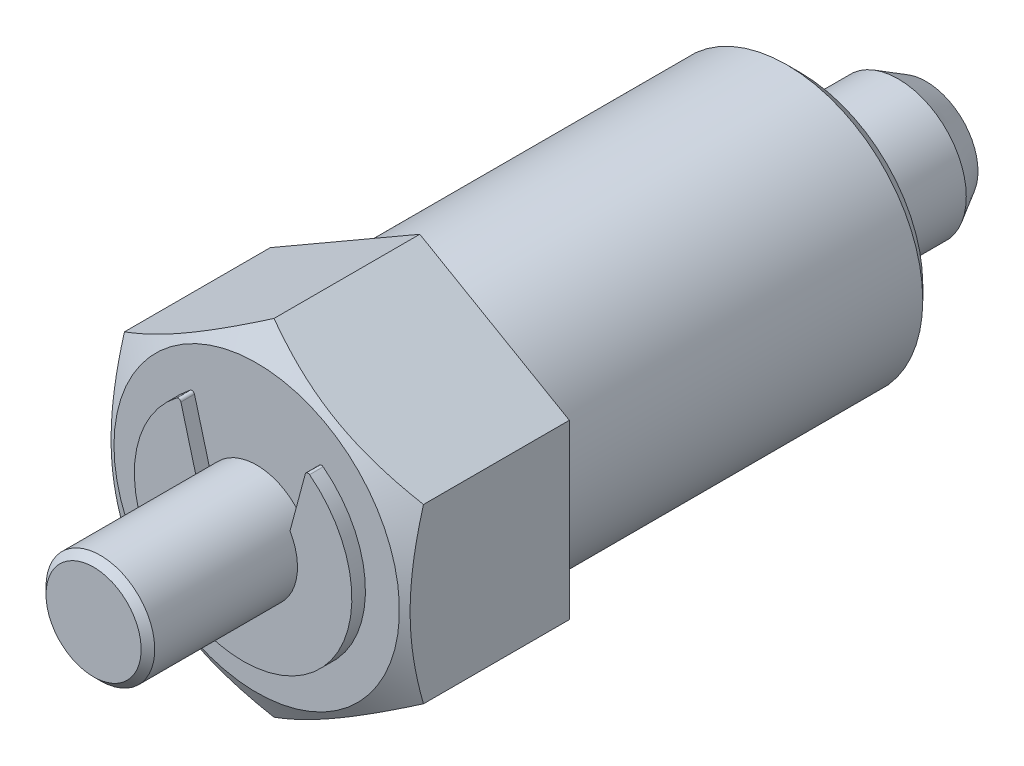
ISO-10303-21;
HEADER;
FILE_DESCRIPTION(('STEP AP214'),'2;1');
FILE_NAME('part.step','',(''),(''),'','','');
FILE_SCHEMA(('AUTOMOTIVE_DESIGN { 1 0 10303 214 1 1 1 1 }'));
ENDSEC;
DATA;
#1=APPLICATION_CONTEXT('core data for automotive mechanical design processes');
#2=APPLICATION_PROTOCOL_DEFINITION('international standard','automotive_design',2000,#1);
#3=PRODUCT_CONTEXT('',#1,'mechanical');
#4=PRODUCT('Part','Part','',(#3));
#5=PRODUCT_RELATED_PRODUCT_CATEGORY('part','',(#4));
#6=PRODUCT_DEFINITION_FORMATION('','',#4);
#7=PRODUCT_DEFINITION_CONTEXT('part definition',#1,'design');
#8=PRODUCT_DEFINITION('design','',#6,#7);
#9=PRODUCT_DEFINITION_SHAPE('','',#8);
#10=(LENGTH_UNIT() NAMED_UNIT(*) SI_UNIT(.MILLI.,.METRE.));
#11=(NAMED_UNIT(*) PLANE_ANGLE_UNIT() SI_UNIT($,.RADIAN.));
#12=(NAMED_UNIT(*) SI_UNIT($,.STERADIAN.) SOLID_ANGLE_UNIT());
#13=UNCERTAINTY_MEASURE_WITH_UNIT(LENGTH_MEASURE(1.E-05),#10,'distance_accuracy_value','');
#14=(GEOMETRIC_REPRESENTATION_CONTEXT(3) GLOBAL_UNCERTAINTY_ASSIGNED_CONTEXT((#13)) GLOBAL_UNIT_ASSIGNED_CONTEXT((#10,
#11,#12)) REPRESENTATION_CONTEXT('',''));
#15=CARTESIAN_POINT('',(0.,0.,0.));
#16=DIRECTION('',(0.,0.,1.));
#17=DIRECTION('',(1.,0.,0.));
#18=AXIS2_PLACEMENT_3D('',#15,#16,#17);
#19=CARTESIAN_POINT('',(10.626,-10.6625637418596,11.9999999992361));
#20=DIRECTION('',(0.,7.16445197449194E-11,-1.));
#21=DIRECTION('',(-1.,0.,0.));
#22=AXIS2_PLACEMENT_3D('',#19,#20,#21);
#23=PLANE('',#22);
#24=CARTESIAN_POINT('',(0.,-8.59728954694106E-10,12.));
#25=DIRECTION('',(0.,7.16445197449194E-11,-1.));
#26=DIRECTION('',(-1.,0.,0.));
#27=AXIS2_PLACEMENT_3D('',#24,#25,#26);
#28=CIRCLE('',#27,10.5);
#29=CARTESIAN_POINT('',(-10.5,-8.59728954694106E-10,12.));
#30=VERTEX_POINT('',#29);
#31=EDGE_CURVE('E260',#30,#30,#28,.T.);
#32=ORIENTED_EDGE('',*,*,#31,.F.);
#33=EDGE_LOOP('',(#32));
#34=FACE_BOUND('',#33,.T.);
#35=DIRECTION('',(-0.258819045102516,-0.96592582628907,-6.92033067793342E-11));
#36=VECTOR('',#35,1.);
#37=CARTESIAN_POINT('',(3.45,2.02422824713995,12.000000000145));
#38=LINE('',#37,#36);
#39=CARTESIAN_POINT('',(4.57541189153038,6.22432260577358,12.0000000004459));
#40=VERTEX_POINT('',#39);
#41=CARTESIAN_POINT('',(3.45,2.02422824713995,12.000000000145));
#42=VERTEX_POINT('',#41);
#43=EDGE_CURVE('E263',#40,#42,#38,.T.);
#44=ORIENTED_EDGE('',*,*,#43,.F.);
#45=CARTESIAN_POINT('',(4.76859705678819,6.17255879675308,12.0000000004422));
#46=DIRECTION('',(0.,-7.16445197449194E-11,1.));
#47=DIRECTION('',(0.,-1.,-7.16445197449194E-11));
#48=AXIS2_PLACEMENT_3D('',#45,#46,#47);
#49=CIRCLE('',#48,0.200000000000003);
#50=CARTESIAN_POINT('',(4.89086877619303,6.33082953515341,12.0000000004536));
#51=VERTEX_POINT('',#50);
#52=EDGE_CURVE('E265',#51,#40,#49,.T.);
#53=ORIENTED_EDGE('',*,*,#52,.F.);
#54=CARTESIAN_POINT('',(0.,-8.59734236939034E-10,12.));
#55=DIRECTION('',(0.,-7.16445197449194E-11,1.));
#56=DIRECTION('',(0.,-1.,-7.16445197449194E-11));
#57=AXIS2_PLACEMENT_3D('',#54,#55,#56);
#58=CIRCLE('',#57,7.99999999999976);
#59=CARTESIAN_POINT('',(-4.89086877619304,6.33082953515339,12.0000000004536));
#60=VERTEX_POINT('',#59);
#61=EDGE_CURVE('E268',#60,#51,#58,.T.);
#62=ORIENTED_EDGE('',*,*,#61,.F.);
#63=CARTESIAN_POINT('',(-4.76859705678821,6.17255879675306,12.0000000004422));
#64=DIRECTION('',(0.,-7.16445197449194E-11,1.));
#65=DIRECTION('',(0.,-1.,-7.16445197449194E-11));
#66=AXIS2_PLACEMENT_3D('',#63,#64,#65);
#67=CIRCLE('',#66,0.200000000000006);
#68=CARTESIAN_POINT('',(-4.57541189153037,6.22432260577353,12.0000000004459));
#69=VERTEX_POINT('',#68);
#70=EDGE_CURVE('E123',#69,#60,#67,.T.);
#71=ORIENTED_EDGE('',*,*,#70,.F.);
#72=DIRECTION('',(-0.258819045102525,0.965925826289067,6.92033067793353E-11));
#73=VECTOR('',#72,1.);
#74=CARTESIAN_POINT('',(-3.45,2.02422824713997,12.000000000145));
#75=LINE('',#74,#73);
#76=CARTESIAN_POINT('',(-3.45,2.02422824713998,12.000000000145));
#77=VERTEX_POINT('',#76);
#78=EDGE_CURVE('E117',#77,#69,#75,.T.);
#79=ORIENTED_EDGE('',*,*,#78,.F.);
#80=CARTESIAN_POINT('',(0.,-8.59728954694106E-10,12.));
#81=DIRECTION('',(0.,-7.16445197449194E-11,1.));
#82=DIRECTION('',(1.,0.,0.));
#83=AXIS2_PLACEMENT_3D('',#80,#81,#82);
#84=CIRCLE('',#83,4.);
#85=EDGE_CURVE('E150',#42,#77,#84,.T.);
#86=ORIENTED_EDGE('',*,*,#85,.F.);
#87=EDGE_LOOP('',(#44,#53,#62,#71,#79,#86));
#88=FACE_BOUND('',#87,.T.);
#89=ADVANCED_FACE('F14',(#34,#88),#23,.F.);
#90=CARTESIAN_POINT('',(0.,-8.59728954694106E-10,12.));
#91=DIRECTION('',(0.,-7.16445197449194E-11,1.));
#92=DIRECTION('',(1.,0.,0.));
#93=AXIS2_PLACEMENT_3D('',#90,#91,#92);
#94=CYLINDRICAL_SURFACE('',#93,4.);
#95=CARTESIAN_POINT('',(0.,-1.68362546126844E-09,23.5));
#96=DIRECTION('',(0.,7.16445197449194E-11,-1.));
#97=DIRECTION('',(-1.,0.,0.));
#98=AXIS2_PLACEMENT_3D('',#95,#96,#97);
#99=CIRCLE('',#98,4.);
#100=CARTESIAN_POINT('',(-4.,-1.68362546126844E-09,23.5));
#101=VERTEX_POINT('',#100);
#102=EDGE_CURVE('E9',#101,#101,#99,.F.);
#103=ORIENTED_EDGE('',*,*,#102,.F.);
#104=EDGE_LOOP('',(#103));
#105=FACE_BOUND('',#104,.T.);
#106=DIRECTION('',(0.,7.16445197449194E-11,-1.));
#107=VECTOR('',#106,1.);
#108=CARTESIAN_POINT('',(3.45,2.0242282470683,13.000000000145));
#109=LINE('',#108,#107);
#110=CARTESIAN_POINT('',(3.45,2.02422824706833,13.000000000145));
#111=VERTEX_POINT('',#110);
#112=EDGE_CURVE('E31',#111,#42,#109,.T.);
#113=ORIENTED_EDGE('',*,*,#112,.T.);
#114=ORIENTED_EDGE('',*,*,#85,.T.);
#115=DIRECTION('',(0.,7.16445197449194E-11,-1.));
#116=VECTOR('',#115,1.);
#117=CARTESIAN_POINT('',(-3.45,2.02422824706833,13.000000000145));
#118=LINE('',#117,#116);
#119=CARTESIAN_POINT('',(-3.45,2.02422824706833,13.000000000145));
#120=VERTEX_POINT('',#119);
#121=EDGE_CURVE('E144',#120,#77,#118,.T.);
#122=ORIENTED_EDGE('',*,*,#121,.F.);
#123=CARTESIAN_POINT('',(0.,-9.31378756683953E-10,13.));
#124=DIRECTION('',(0.,7.16445197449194E-11,-1.));
#125=DIRECTION('',(0.,-1.,-7.16445197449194E-11));
#126=AXIS2_PLACEMENT_3D('',#123,#124,#125);
#127=CIRCLE('',#126,4.);
#128=EDGE_CURVE('E135',#111,#120,#127,.T.);
#129=ORIENTED_EDGE('',*,*,#128,.F.);
#130=EDGE_LOOP('',(#113,#114,#122,#129));
#131=FACE_BOUND('',#130,.T.);
#132=ADVANCED_FACE('F148',(#105,#131),#94,.T.);
#133=CARTESIAN_POINT('',(-7.71365193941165E-11,2.4530655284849E-09,-28.0000000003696));
#134=DIRECTION('',(-1.,0.,0.));
#135=DIRECTION('',(0.,7.16445197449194E-11,-1.));
#136=AXIS2_PLACEMENT_3D('',#133,#134,#135);
#137=SPHERICAL_SURFACE('',#136,10.);
#138=CARTESIAN_POINT('',(0.,2.66811572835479E-09,-37.2409344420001));
#139=DIRECTION('',(0.,-7.16445197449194E-11,1.));
#140=DIRECTION('',(1.,0.,0.));
#141=AXIS2_PLACEMENT_3D('',#138,#139,#140);
#142=CIRCLE('',#141,3.82166595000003);
#143=CARTESIAN_POINT('',(3.82166595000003,2.66811572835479E-09,-37.2409344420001));
#144=VERTEX_POINT('',#143);
#145=EDGE_CURVE('E18',#144,#144,#142,.T.);
#146=ORIENTED_EDGE('',*,*,#145,.F.);
#147=EDGE_LOOP('',(#146));
#148=FACE_BOUND('',#147,.T.);
#149=ADVANCED_FACE('F167',(#148),#137,.T.);
#150=CARTESIAN_POINT('',(0.,2.66811572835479E-09,-37.2409344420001));
#151=DIRECTION('',(0.,-7.16445197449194E-11,1.));
#152=DIRECTION('',(1.,0.,0.));
#153=AXIS2_PLACEMENT_3D('',#150,#151,#152);
#154=CONICAL_SURFACE('',#153,3.82166595,0.523598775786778);
#155=CARTESIAN_POINT('',(0.,2.52189935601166E-09,-35.2));
#156=DIRECTION('',(0.,7.16445197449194E-11,-1.));
#157=DIRECTION('',(-1.,0.,0.));
#158=AXIS2_PLACEMENT_3D('',#155,#156,#157);
#159=CIRCLE('',#158,5.);
#160=CARTESIAN_POINT('',(-5.,2.52189935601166E-09,-35.2));
#161=VERTEX_POINT('',#160);
#162=EDGE_CURVE('E498',#161,#161,#159,.F.);
#163=ORIENTED_EDGE('',*,*,#162,.F.);
#164=EDGE_LOOP('',(#163));
#165=FACE_BOUND('',#164,.T.);
#166=ORIENTED_EDGE('',*,*,#145,.T.);
#167=EDGE_LOOP('',(#166));
#168=FACE_BOUND('',#167,.T.);
#169=ADVANCED_FACE('F171',(#165,#168),#154,.T.);
#170=CARTESIAN_POINT('',(0.,2.00606198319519E-09,-28.));
#171=DIRECTION('',(0.,7.16445197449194E-11,-1.));
#172=DIRECTION('',(-1.,0.,0.));
#173=AXIS2_PLACEMENT_3D('',#170,#171,#172);
#174=CYLINDRICAL_SURFACE('',#173,5.);
#175=ORIENTED_EDGE('',*,*,#162,.T.);
#176=EDGE_LOOP('',(#175));
#177=FACE_BOUND('',#176,.T.);
#178=CARTESIAN_POINT('',(0.,2.00606198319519E-09,-28.));
#179=DIRECTION('',(0.,7.16445197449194E-11,-1.));
#180=DIRECTION('',(-1.,0.,0.));
#181=AXIS2_PLACEMENT_3D('',#178,#179,#180);
#182=CIRCLE('',#181,5.);
#183=CARTESIAN_POINT('',(-5.,2.00606198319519E-09,-28.));
#184=VERTEX_POINT('',#183);
#185=EDGE_CURVE('E501',#184,#184,#182,.T.);
#186=ORIENTED_EDGE('',*,*,#185,.T.);
#187=EDGE_LOOP('',(#186));
#188=FACE_BOUND('',#187,.T.);
#189=ADVANCED_FACE('F177',(#177,#188),#174,.T.);
#190=CARTESIAN_POINT('',(-9.108325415,-9.17838616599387,-28.0000000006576));
#191=DIRECTION('',(0.,-7.16445197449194E-11,1.));
#192=DIRECTION('',(1.,0.,0.));
#193=AXIS2_PLACEMENT_3D('',#190,#191,#192);
#194=PLANE('',#193);
#195=ORIENTED_EDGE('',*,*,#185,.F.);
#196=EDGE_LOOP('',(#195));
#197=FACE_BOUND('',#196,.T.);
#198=CARTESIAN_POINT('',(0.,2.00606198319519E-09,-28.));
#199=DIRECTION('',(0.,-7.16445197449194E-11,1.));
#200=DIRECTION('',(1.,0.,0.));
#201=AXIS2_PLACEMENT_3D('',#198,#199,#200);
#202=CIRCLE('',#201,9.);
#203=CARTESIAN_POINT('',(9.,2.00606198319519E-09,-28.));
#204=VERTEX_POINT('',#203);
#205=EDGE_CURVE('E497',#204,#204,#202,.T.);
#206=ORIENTED_EDGE('',*,*,#205,.F.);
#207=EDGE_LOOP('',(#206));
#208=FACE_BOUND('',#207,.T.);
#209=ADVANCED_FACE('F181',(#197,#208),#194,.F.);
#210=CARTESIAN_POINT('',(0.,2.00606198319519E-09,-28.));
#211=DIRECTION('',(0.,-7.16445197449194E-11,1.));
#212=DIRECTION('',(1.,0.,0.));
#213=AXIS2_PLACEMENT_3D('',#210,#211,#212);
#214=CONICAL_SURFACE('',#213,9.,0.785398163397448);
#215=ORIENTED_EDGE('',*,*,#205,.T.);
#216=EDGE_LOOP('',(#215));
#217=FACE_BOUND('',#216,.T.);
#218=CARTESIAN_POINT('',(0.,1.93442484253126E-09,-27.));
#219=DIRECTION('',(0.,7.16445197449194E-11,-1.));
#220=DIRECTION('',(-1.,0.,0.));
#221=AXIS2_PLACEMENT_3D('',#218,#219,#220);
#222=CIRCLE('',#221,10.);
#223=CARTESIAN_POINT('',(-10.,1.93442484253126E-09,-27.));
#224=VERTEX_POINT('',#223);
#225=EDGE_CURVE('E494',#224,#224,#222,.F.);
#226=ORIENTED_EDGE('',*,*,#225,.F.);
#227=EDGE_LOOP('',(#226));
#228=FACE_BOUND('',#227,.T.);
#229=ADVANCED_FACE('F183',(#217,#228),#214,.T.);
#230=CARTESIAN_POINT('',(0.,0.,0.));
#231=DIRECTION('',(0.,7.16445197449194E-11,-1.));
#232=DIRECTION('',(-1.,0.,0.));
#233=AXIS2_PLACEMENT_3D('',#230,#231,#232);
#234=CYLINDRICAL_SURFACE('',#233,10.);
#235=CARTESIAN_POINT('',(0.,0.,0.));
#236=DIRECTION('',(0.,7.16445197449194E-11,-1.));
#237=DIRECTION('',(-1.,0.,0.));
#238=AXIS2_PLACEMENT_3D('',#235,#236,#237);
#239=CIRCLE('',#238,10.);
#240=CARTESIAN_POINT('',(-10.,0.,0.));
#241=VERTEX_POINT('',#240);
#242=EDGE_CURVE('E484',#241,#241,#239,.F.);
#243=ORIENTED_EDGE('',*,*,#242,.F.);
#244=EDGE_LOOP('',(#243));
#245=FACE_BOUND('',#244,.T.);
#246=ORIENTED_EDGE('',*,*,#225,.T.);
#247=EDGE_LOOP('',(#246));
#248=FACE_BOUND('',#247,.T.);
#249=ADVANCED_FACE('F186',(#245,#248),#234,.T.);
#250=CARTESIAN_POINT('',(11.,-12.8541263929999,-9.20902243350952E-10));
#251=DIRECTION('',(0.,7.16445197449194E-11,-1.));
#252=DIRECTION('',(-1.,0.,0.));
#253=AXIS2_PLACEMENT_3D('',#250,#251,#252);
#254=PLANE('',#253);
#255=ORIENTED_EDGE('',*,*,#242,.T.);
#256=EDGE_LOOP('',(#255));
#257=FACE_BOUND('',#256,.T.);
#258=DIRECTION('',(0.,1.,7.16445197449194E-11));
#259=VECTOR('',#258,1.);
#260=CARTESIAN_POINT('',(11.,5.00072205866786E-10,0.));
#261=LINE('',#260,#259);
#262=CARTESIAN_POINT('',(11.,-6.35085296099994,-4.54997151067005E-10));
#263=VERTEX_POINT('',#262);
#264=CARTESIAN_POINT('',(11.,6.35085296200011,4.5502490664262E-10));
#265=VERTEX_POINT('',#264);
#266=EDGE_CURVE('E489',#263,#265,#261,.T.);
#267=ORIENTED_EDGE('',*,*,#266,.F.);
#268=DIRECTION('',(0.866025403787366,0.49999999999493,3.58222598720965E-11));
#269=VECTOR('',#268,1.);
#270=CARTESIAN_POINT('',(5.5,-9.52627944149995,-6.82481848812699E-10));
#271=LINE('',#270,#269);
#272=CARTESIAN_POINT('',(0.,-12.701705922,-9.0999430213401E-10));
#273=VERTEX_POINT('',#272);
#274=EDGE_CURVE('E492',#273,#263,#271,.T.);
#275=ORIENTED_EDGE('',*,*,#274,.F.);
#276=DIRECTION('',(0.866025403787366,-0.49999999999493,-3.58222598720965E-11));
#277=VECTOR('',#276,1.);
#278=CARTESIAN_POINT('',(-5.5,-9.52627944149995,-6.82481848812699E-10));
#279=LINE('',#278,#277);
#280=CARTESIAN_POINT('',(-11.0000000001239,-6.35085296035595,-4.54997151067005E-10));
#281=VERTEX_POINT('',#280);
#282=EDGE_CURVE('E87',#281,#273,#279,.T.);
#283=ORIENTED_EDGE('',*,*,#282,.F.);
#284=DIRECTION('',(0.,-1.,-7.16445197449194E-11));
#285=VECTOR('',#284,1.);
#286=CARTESIAN_POINT('',(-11.,5.00072205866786E-10,0.));
#287=LINE('',#286,#285);
#288=CARTESIAN_POINT('',(-11.,6.35085296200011,4.5502490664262E-10));
#289=VERTEX_POINT('',#288);
#290=EDGE_CURVE('E475',#289,#281,#287,.T.);
#291=ORIENTED_EDGE('',*,*,#290,.F.);
#292=DIRECTION('',(-0.866025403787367,-0.499999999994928,-3.58222598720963E-11));
#293=VECTOR('',#292,1.);
#294=CARTESIAN_POINT('',(-5.5,9.52627944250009,6.82509604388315E-10));
#295=LINE('',#294,#293);
#296=CARTESIAN_POINT('',(0.,12.7017059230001,9.10022057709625E-10));
#297=VERTEX_POINT('',#296);
#298=EDGE_CURVE('E67',#297,#289,#295,.T.);
#299=ORIENTED_EDGE('',*,*,#298,.F.);
#300=DIRECTION('',(-0.866025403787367,0.499999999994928,3.58222598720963E-11));
#301=VECTOR('',#300,1.);
#302=CARTESIAN_POINT('',(5.5,9.52627944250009,6.82509604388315E-10));
#303=LINE('',#302,#301);
#304=EDGE_CURVE('E485',#265,#297,#303,.T.);
#305=ORIENTED_EDGE('',*,*,#304,.F.);
#306=EDGE_LOOP('',(#267,#275,#283,#291,#299,#305));
#307=FACE_BOUND('',#306,.T.);
#308=ADVANCED_FACE('F190',(#257,#307),#254,.T.);
#309=CARTESIAN_POINT('',(-11.,-6.35085296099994,-4.54997151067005E-10));
#310=DIRECTION('',(-0.49999999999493,-0.866025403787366,-6.20459741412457E-11));
#311=DIRECTION('',(0.866025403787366,-0.49999999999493,-3.58222598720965E-11));
#312=AXIS2_PLACEMENT_3D('',#309,#310,#311);
#313=PLANE('',#312);
#314=DIRECTION('',(0.,-7.16445197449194E-11,1.));
#315=VECTOR('',#314,1.);
#316=CARTESIAN_POINT('',(-11.,-6.35085296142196,5.89079640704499));
#317=LINE('',#316,#315);
#318=CARTESIAN_POINT('',(-11.0000000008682,-6.35085296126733,10.7288444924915));
#319=VERTEX_POINT('',#318);
#320=EDGE_CURVE('E479',#281,#319,#317,.T.);
#321=ORIENTED_EDGE('',*,*,#320,.F.);
#322=ORIENTED_EDGE('',*,*,#282,.T.);
#323=DIRECTION('',(0.,7.16445197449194E-11,-1.));
#324=VECTOR('',#323,1.);
#325=CARTESIAN_POINT('',(0.,-12.7017059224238,5.91538969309));
#326=LINE('',#325,#324);
#327=CARTESIAN_POINT('',(7.50439263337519E-10,-12.7017059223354,10.7288444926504));
#328=VERTEX_POINT('',#327);
#329=EDGE_CURVE('E164',#328,#273,#326,.T.);
#330=ORIENTED_EDGE('',*,*,#329,.F.);
#331=CARTESIAN_POINT('',(-11.0000000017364,-6.35085296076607,10.7288444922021));
#332=CARTESIAN_POINT('',(-10.7581978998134,-6.49045746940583,10.8094296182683));
#333=CARTESIAN_POINT('',(-10.5154942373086,-6.63058249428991,10.886357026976));
#334=CARTESIAN_POINT('',(-10.0281406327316,-6.91195622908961,11.0318815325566));
#335=CARTESIAN_POINT('',(-9.78349007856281,-7.05320529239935,11.1004758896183));
#336=CARTESIAN_POINT('',(-9.04559653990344,-7.47922832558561,11.2924318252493));
#337=CARTESIAN_POINT('',(-8.54944068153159,-7.76568404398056,11.4016142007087));
#338=CARTESIAN_POINT('',(-7.80696622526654,-8.19435187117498,11.5296384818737));
#339=CARTESIAN_POINT('',(-7.56286565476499,-8.3352834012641,11.5661073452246));
#340=CARTESIAN_POINT('',(-7.07353439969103,-8.61779893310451,11.6272621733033));
#341=CARTESIAN_POINT('',(-6.82830369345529,-8.75938294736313,11.6519479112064));
#342=CARTESIAN_POINT('',(-6.33743351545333,-9.04278697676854,11.6889041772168));
#343=CARTESIAN_POINT('',(-6.09179487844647,-9.18460650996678,11.7011894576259));
#344=CARTESIAN_POINT('',(-5.60029010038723,-9.46837692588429,11.7130830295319));
#345=CARTESIAN_POINT('',(-5.35442396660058,-9.61032780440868,11.7126917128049));
#346=CARTESIAN_POINT('',(-4.89478887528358,-9.87569824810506,11.7001175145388));
#347=CARTESIAN_POINT('',(-4.68098711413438,-9.99913675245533,11.6894684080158));
#348=CARTESIAN_POINT('',(-4.25387535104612,-10.2457298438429,11.6587846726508));
#349=CARTESIAN_POINT('',(-4.04056538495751,-10.3688844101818,11.6387493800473));
#350=CARTESIAN_POINT('',(-3.61455312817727,-10.6148427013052,11.5896425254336));
#351=CARTESIAN_POINT('',(-3.40185148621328,-10.7376460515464,11.5605635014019));
#352=CARTESIAN_POINT('',(-2.97744534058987,-10.9826770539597,11.4938793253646));
#353=CARTESIAN_POINT('',(-2.76574090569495,-11.1049046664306,11.4562735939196));
#354=CARTESIAN_POINT('',(-2.12310090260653,-11.4759330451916,11.3297157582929));
#355=CARTESIAN_POINT('',(-1.69402620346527,-11.7236594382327,11.2281451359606));
#356=CARTESIAN_POINT('',(-0.842274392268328,-12.2154185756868,10.9976221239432));
#357=CARTESIAN_POINT('',(-0.419586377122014,-12.4594576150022,10.8687238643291));
#358=CARTESIAN_POINT('',(1.16254223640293E-09,-12.7017059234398,10.7288444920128));
#359=B_SPLINE_CURVE_WITH_KNOTS('',3,(#331,#332,#333,#334,#335,#336,#337,#338,#339,#340,#341,
#342,#343,#344,#345,#346,#347,#348,#349,#350,#351,#352,#353,#354,#355,#356,#357,#358),
.UNSPECIFIED.,.F.,.F.,(4,2,2,2,2,2,2,2,2,2,2,2,2,4),(0.,0.871747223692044,1.74378029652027,
3.49155822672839,4.34399745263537,5.19645308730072,6.04789339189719,6.8993073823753,
7.64044859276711,8.38164222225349,9.12344904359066,9.86530629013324,11.3816421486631,
12.8950020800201),.UNSPECIFIED.);
#360=EDGE_CURVE('E220',#319,#328,#359,.T.);
#361=ORIENTED_EDGE('',*,*,#360,.F.);
#362=EDGE_LOOP('',(#321,#322,#330,#361));
#363=FACE_BOUND('',#362,.T.);
#364=ADVANCED_FACE('F392',(#363),#313,.T.);
#365=CARTESIAN_POINT('',(0.,-12.701705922,-9.0999430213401E-10));
#366=DIRECTION('',(0.49999999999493,-0.866025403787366,-6.20459741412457E-11));
#367=DIRECTION('',(0.866025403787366,0.49999999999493,3.58222598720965E-11));
#368=AXIS2_PLACEMENT_3D('',#365,#366,#367);
#369=PLANE('',#368);
#370=ORIENTED_EDGE('',*,*,#329,.T.);
#371=ORIENTED_EDGE('',*,*,#274,.T.);
#372=DIRECTION('',(0.,7.16445197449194E-11,-1.));
#373=VECTOR('',#372,1.);
#374=CARTESIAN_POINT('',(11.,-6.35085296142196,5.89079640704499));
#375=LINE('',#374,#373);
#376=CARTESIAN_POINT('',(11.,-6.35085296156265,10.7288444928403));
#377=VERTEX_POINT('',#376);
#378=EDGE_CURVE('E491',#377,#263,#375,.T.);
#379=ORIENTED_EDGE('',*,*,#378,.F.);
#380=CARTESIAN_POINT('',(1.50087855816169E-09,-12.7017059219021,10.7288444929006));
#381=CARTESIAN_POINT('',(0.241802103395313,-12.5621014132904,10.8094296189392));
#382=CARTESIAN_POINT('',(0.4845057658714,-12.4219763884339,10.8863570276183));
#383=CARTESIAN_POINT('',(0.97185937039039,-12.1406026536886,11.0318815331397));
#384=CARTESIAN_POINT('',(1.21650992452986,-11.9993535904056,11.1004758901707));
#385=CARTESIAN_POINT('',(1.95440346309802,-11.5733305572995,11.2924318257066));
#386=CARTESIAN_POINT('',(2.45055932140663,-11.2868748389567,11.4016142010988));
#387=CARTESIAN_POINT('',(3.19303377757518,-10.8582070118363,11.5296384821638));
#388=CARTESIAN_POINT('',(3.43713434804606,-10.7172754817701,11.5661073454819));
#389=CARTESIAN_POINT('',(3.92646560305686,-10.434759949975,11.6272621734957));
#390=CARTESIAN_POINT('',(4.1716963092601,-10.2931759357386,11.6519479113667));
#391=CARTESIAN_POINT('',(4.66256648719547,-10.009771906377,11.6889041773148));
#392=CARTESIAN_POINT('',(4.90820512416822,-9.86795237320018,11.7011894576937));
#393=CARTESIAN_POINT('',(5.3997099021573,-9.58418195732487,11.7130830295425));
#394=CARTESIAN_POINT('',(5.64557603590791,-9.44223107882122,11.7126917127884));
#395=CARTESIAN_POINT('',(6.10521112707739,-9.17686063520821,11.7001175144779));
#396=CARTESIAN_POINT('',(6.31901288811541,-9.05342213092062,11.6894684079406));
#397=CARTESIAN_POINT('',(6.74612465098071,-8.80682903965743,11.6587846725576));
#398=CARTESIAN_POINT('',(6.95943461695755,-8.6836744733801,11.6387493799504));
#399=CARTESIAN_POINT('',(7.38544687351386,-8.43771618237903,11.5896425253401));
#400=CARTESIAN_POINT('',(7.59814851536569,-8.31491283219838,11.5605635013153));
#401=CARTESIAN_POINT('',(8.0225546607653,-8.06988182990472,11.4938793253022));
#402=CARTESIAN_POINT('',(8.23425909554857,-7.94765421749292,11.4562735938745));
#403=CARTESIAN_POINT('',(8.87689909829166,-7.57662583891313,11.3297157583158));
#404=CARTESIAN_POINT('',(9.30597379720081,-7.32889944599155,11.2281451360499));
#405=CARTESIAN_POINT('',(10.1577256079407,-6.83714030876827,10.9976221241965));
#406=CARTESIAN_POINT('',(10.580413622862,-6.59310126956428,10.8687238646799));
#407=CARTESIAN_POINT('',(11.0000000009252,-6.35085296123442,10.7288444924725));
#408=B_SPLINE_CURVE_WITH_KNOTS('',3,(#380,#381,#382,#383,#384,#385,#386,#387,#388,#389,#390,
#391,#392,#393,#394,#395,#396,#397,#398,#399,#400,#401,#402,#403,#404,#405,#406,#407),
.UNSPECIFIED.,.F.,.F.,(4,2,2,2,2,2,2,2,2,2,2,2,2,4),(0.,0.87174722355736,1.74378029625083,
3.49155822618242,4.34399745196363,5.19645308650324,6.04789339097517,6.89930738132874,
7.64044859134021,8.38164222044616,9.12344904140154,9.86530628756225,11.3816421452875,
12.895002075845),.UNSPECIFIED.);
#409=EDGE_CURVE('E212',#328,#377,#408,.T.);
#410=ORIENTED_EDGE('',*,*,#409,.F.);
#411=EDGE_LOOP('',(#370,#371,#379,#410));
#412=FACE_BOUND('',#411,.T.);
#413=ADVANCED_FACE('F383',(#412),#369,.T.);
#414=CARTESIAN_POINT('',(11.,-6.35085296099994,-4.54997151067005E-10));
#415=DIRECTION('',(1.,0.,0.));
#416=DIRECTION('',(0.,1.,7.16445197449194E-11));
#417=AXIS2_PLACEMENT_3D('',#414,#415,#416);
#418=PLANE('',#417);
#419=ORIENTED_EDGE('',*,*,#378,.T.);
#420=ORIENTED_EDGE('',*,*,#266,.T.);
#421=DIRECTION('',(0.,7.16445197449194E-11,-1.));
#422=VECTOR('',#421,1.);
#423=CARTESIAN_POINT('',(11.,6.35085296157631,5.91538969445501));
#424=LINE('',#423,#422);
#425=CARTESIAN_POINT('',(11.000000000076,6.35085296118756,10.7288444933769));
#426=VERTEX_POINT('',#425);
#427=EDGE_CURVE('E488',#426,#265,#424,.T.);
#428=ORIENTED_EDGE('',*,*,#427,.F.);
#429=CARTESIAN_POINT('',(10.9999999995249,-6.35085296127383,10.7288444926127));
#430=CARTESIAN_POINT('',(10.9999999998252,-6.09009949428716,10.8041061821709));
#431=CARTESIAN_POINT('',(10.9999999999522,-5.82843667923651,10.8761743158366));
#432=CARTESIAN_POINT('',(11.0000000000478,-5.30313903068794,11.0131075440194));
#433=CARTESIAN_POINT('',(11.0000000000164,-5.03950353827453,11.0779701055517));
#434=CARTESIAN_POINT('',(10.999999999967,-4.24465324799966,11.2606851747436));
#435=CARTESIAN_POINT('',(10.9999999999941,-3.71050929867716,11.3663654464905));
#436=CARTESIAN_POINT('',(11.0000000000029,-2.9108651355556,11.4943411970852));
#437=CARTESIAN_POINT('',(11.0000000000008,-2.64770882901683,11.5316381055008));
#438=CARTESIAN_POINT('',(10.9999999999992,-2.12016490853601,11.5961459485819));
#439=CARTESIAN_POINT('',(10.9999999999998,-1.85577739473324,11.6233576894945));
#440=CARTESIAN_POINT('',(11.0000000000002,-1.32638737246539,11.6671082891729));
#441=CARTESIAN_POINT('',(11.0000000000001,-1.06138575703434,11.6836579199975));
#442=CARTESIAN_POINT('',(10.9999999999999,-0.530922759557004,11.7057661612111));
#443=CARTESIAN_POINT('',(11.,-0.265461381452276,11.7113248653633));
#444=CARTESIAN_POINT('',(11.,0.265461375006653,11.7113248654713));
#445=CARTESIAN_POINT('',(11.,0.530922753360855,11.7057661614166));
#446=CARTESIAN_POINT('',(11.,1.06138575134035,11.6836579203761));
#447=CARTESIAN_POINT('',(11.,1.32638736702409,11.6671082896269));
#448=CARTESIAN_POINT('',(11.,1.85577738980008,11.623357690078));
#449=CARTESIAN_POINT('',(11.,2.12016490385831,11.5961459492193));
#450=CARTESIAN_POINT('',(11.,2.64770882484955,11.531638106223));
#451=CARTESIAN_POINT('',(11.,2.91086513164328,11.4943411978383));
#452=CARTESIAN_POINT('',(11.,3.71050929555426,11.3663654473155));
#453=CARTESIAN_POINT('',(11.,4.24465324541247,11.2606851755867));
#454=CARTESIAN_POINT('',(11.,5.0395035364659,11.0779701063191));
#455=CARTESIAN_POINT('',(11.,5.30313902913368,11.0131075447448));
#456=CARTESIAN_POINT('',(11.,5.82843667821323,10.8761743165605));
#457=CARTESIAN_POINT('',(11.,6.09009949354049,10.8041061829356));
#458=CARTESIAN_POINT('',(11.,6.35085296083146,10.7288444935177));
#459=B_SPLINE_CURVE_WITH_KNOTS('',3,(#429,#430,#431,#432,#433,#434,#435,#436,#437,#438,#439,
#440,#441,#442,#443,#444,#445,#446,#447,#448,#449,#450,#451,#452,#453,#454,#455,#456,#457,#458),
.UNSPECIFIED.,.F.,.F.,(4,2,2,2,2,2,2,2,2,2,2,2,2,2,4),(0.,0.814136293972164,1.62855788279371,
3.26057062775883,4.05777422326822,4.85491407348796,5.6512472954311,6.44757372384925,
7.24390015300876,8.04023337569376,8.83737322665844,9.63457682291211,11.2665895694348,
12.081011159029,12.8951474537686),.UNSPECIFIED.);
#460=EDGE_CURVE('E466',#377,#426,#459,.T.);
#461=ORIENTED_EDGE('',*,*,#460,.F.);
#462=EDGE_LOOP('',(#419,#420,#428,#461));
#463=FACE_BOUND('',#462,.T.);
#464=ADVANCED_FACE('F374',(#463),#418,.T.);
#465=CARTESIAN_POINT('',(11.,6.35085296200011,4.5502490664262E-10));
#466=DIRECTION('',(0.499999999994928,0.866025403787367,6.20459741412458E-11));
#467=DIRECTION('',(-0.866025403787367,0.499999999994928,3.58222598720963E-11));
#468=AXIS2_PLACEMENT_3D('',#465,#466,#467);
#469=PLANE('',#468);
#470=ORIENTED_EDGE('',*,*,#427,.T.);
#471=ORIENTED_EDGE('',*,*,#304,.T.);
#472=DIRECTION('',(0.,7.16445197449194E-11,-1.));
#473=VECTOR('',#472,1.);
#474=CARTESIAN_POINT('',(0.,12.7017059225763,5.91538969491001));
#475=LINE('',#474,#473);
#476=CARTESIAN_POINT('',(1.40241265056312E-10,12.7017059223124,10.7288444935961));
#477=VERTEX_POINT('',#476);
#478=EDGE_CURVE('E487',#477,#297,#475,.T.);
#479=ORIENTED_EDGE('',*,*,#478,.F.);
#480=CARTESIAN_POINT('',(11.0000000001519,6.35085296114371,10.7288444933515));
#481=CARTESIAN_POINT('',(10.7581978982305,6.49045746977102,10.8094296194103));
#482=CARTESIAN_POINT('',(10.5154942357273,6.63058249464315,10.8863570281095));
#483=CARTESIAN_POINT('',(10.0281406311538,6.91195622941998,11.0318815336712));
#484=CARTESIAN_POINT('',(9.78349007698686,7.05320529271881,11.1004758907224));
#485=CARTESIAN_POINT('',(9.04559653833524,7.47922832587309,11.2924318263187));
#486=CARTESIAN_POINT('',(8.54944067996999,7.76568404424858,11.401614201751));
#487=CARTESIAN_POINT('',(7.80696622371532,8.19435187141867,11.5296384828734));
#488=CARTESIAN_POINT('',(7.56286565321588,8.33528340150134,11.5661073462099));
#489=CARTESIAN_POINT('',(7.07353439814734,8.61779893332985,11.6272621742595));
#490=CARTESIAN_POINT('',(6.82830369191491,8.75938294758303,11.6519479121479));
#491=CARTESIAN_POINT('',(6.33743351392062,9.04278697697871,11.6889041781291));
#492=CARTESIAN_POINT('',(6.09179487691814,9.18460651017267,11.7011894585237));
#493=CARTESIAN_POINT('',(5.60029009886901,9.46837692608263,11.7130830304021));
#494=CARTESIAN_POINT('',(5.35442396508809,9.61032780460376,11.7126917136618));
#495=CARTESIAN_POINT('',(4.8947888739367,9.87569824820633,11.7001175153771));
#496=CARTESIAN_POINT('',(4.68098711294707,9.999136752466,11.6894684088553));
#497=CARTESIAN_POINT('',(4.25387535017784,10.2457298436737,11.658784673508));
#498=CARTESIAN_POINT('',(4.04056538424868,10.3688844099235,11.638749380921));
#499=CARTESIAN_POINT('',(3.61455312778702,10.6148427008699,11.5896425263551));
#500=CARTESIAN_POINT('',(3.40185148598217,10.7376460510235,11.5605635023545));
#501=CARTESIAN_POINT('',(2.97744534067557,10.9826770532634,11.4938793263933));
#502=CARTESIAN_POINT('',(2.76574090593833,11.1049046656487,11.4562735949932));
#503=CARTESIAN_POINT('',(2.12310090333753,11.4759330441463,11.3297157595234));
#504=CARTESIAN_POINT('',(1.69402620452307,11.7236594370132,11.2281451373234));
#505=CARTESIAN_POINT('',(0.842274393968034,12.2154185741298,10.9976221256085));
#506=CARTESIAN_POINT('',(0.419586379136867,12.4594576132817,10.8687238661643));
#507=CARTESIAN_POINT('',(1.16237861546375E-09,12.7017059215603,10.7288444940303));
#508=B_SPLINE_CURVE_WITH_KNOTS('',3,(#480,#481,#482,#483,#484,#485,#486,#487,#488,#489,#490,
#491,#492,#493,#494,#495,#496,#497,#498,#499,#500,#501,#502,#503,#504,#505,#506,#507),
.UNSPECIFIED.,.F.,.F.,(4,2,2,2,2,2,2,2,2,2,2,2,2,4),(0.,0.871747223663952,1.74378029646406,
3.49155822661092,4.34399745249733,5.19645308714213,6.04789339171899,6.89930738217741,
7.64044859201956,8.38164222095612,9.12344904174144,9.86530628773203,11.3816421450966,
12.8950020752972),.UNSPECIFIED.);
#509=EDGE_CURVE('E201',#426,#477,#508,.T.);
#510=ORIENTED_EDGE('',*,*,#509,.F.);
#511=EDGE_LOOP('',(#470,#471,#479,#510));
#512=FACE_BOUND('',#511,.T.);
#513=ADVANCED_FACE('F243',(#512),#469,.T.);
#514=CARTESIAN_POINT('',(0.,12.7017059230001,9.10022057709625E-10));
#515=DIRECTION('',(-0.499999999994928,0.866025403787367,6.20459741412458E-11));
#516=DIRECTION('',(-0.866025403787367,-0.499999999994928,-3.58222598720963E-11));
#517=AXIS2_PLACEMENT_3D('',#514,#515,#516);
#518=PLANE('',#517);
#519=ORIENTED_EDGE('',*,*,#478,.T.);
#520=ORIENTED_EDGE('',*,*,#298,.T.);
#521=DIRECTION('',(0.,7.16445197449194E-11,-1.));
#522=VECTOR('',#521,1.);
#523=CARTESIAN_POINT('',(-11.,6.35085296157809,5.89079640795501));
#524=LINE('',#523,#522);
#525=CARTESIAN_POINT('',(-11.,6.35085296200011,10.7288444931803));
#526=VERTEX_POINT('',#525);
#527=EDGE_CURVE('E40',#526,#289,#524,.T.);
#528=ORIENTED_EDGE('',*,*,#527,.F.);
#529=CARTESIAN_POINT('',(3.1737989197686E-10,12.7017059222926,10.7288444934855));
#530=CARTESIAN_POINT('',(-0.241802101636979,12.5621014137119,10.8094296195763));
#531=CARTESIAN_POINT('',(-0.484505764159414,12.4219763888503,10.8863570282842));
#532=CARTESIAN_POINT('',(-0.971859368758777,12.1406026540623,11.0318815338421));
#533=CARTESIAN_POINT('',(-1.21650992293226,11.9993535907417,11.1004758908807));
#534=CARTESIAN_POINT('',(-1.95440346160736,11.5733305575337,11.2924318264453));
#535=CARTESIAN_POINT('',(-2.45055931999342,11.2868748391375,11.4016142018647));
#536=CARTESIAN_POINT('',(-3.19303377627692,10.8582070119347,11.5296384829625));
#537=CARTESIAN_POINT('',(-3.43713434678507,10.7172754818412,11.5661073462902));
#538=CARTESIAN_POINT('',(-3.92646560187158,10.4347599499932,11.6272621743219));
#539=CARTESIAN_POINT('',(-4.17169630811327,10.2931759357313,11.6519479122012));
#540=CARTESIAN_POINT('',(-4.66256648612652,10.0097719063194,11.6889041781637));
#541=CARTESIAN_POINT('',(-4.90820512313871,9.86795237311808,11.7011894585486));
#542=CARTESIAN_POINT('',(-5.39970990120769,9.58418195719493,11.7130830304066));
#543=CARTESIAN_POINT('',(-5.64557603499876,9.44223107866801,11.7126917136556));
#544=CARTESIAN_POINT('',(-6.10521112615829,9.17686063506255,11.7001175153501));
#545=CARTESIAN_POINT('',(-6.31901288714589,9.05342213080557,11.6894684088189));
#546=CARTESIAN_POINT('',(-6.74612464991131,8.80682903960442,11.6587846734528));
#547=CARTESIAN_POINT('',(-6.95943461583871,8.68367447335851,11.6387493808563));
#548=CARTESIAN_POINT('',(-7.385446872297,8.43771618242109,11.5896425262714));
#549=CARTESIAN_POINT('',(-7.59814851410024,8.31491283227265,11.5605635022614));
#550=CARTESIAN_POINT('',(-8.02255465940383,8.06988183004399,11.4938793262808));
#551=CARTESIAN_POINT('',(-8.23425909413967,7.94765421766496,11.4562735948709));
#552=CARTESIAN_POINT('',(-8.87689909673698,7.57662583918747,11.3297157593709));
#553=CARTESIAN_POINT('',(-9.30597379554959,7.32889944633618,11.2281451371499));
#554=CARTESIAN_POINT('',(-10.1577256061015,6.83714030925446,10.9976221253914));
#555=CARTESIAN_POINT('',(-10.5804136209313,6.59310127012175,10.8687238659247));
#556=CARTESIAN_POINT('',(-10.9999999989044,6.35085296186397,10.7288444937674));
#557=B_SPLINE_CURVE_WITH_KNOTS('',3,(#529,#530,#531,#532,#533,#534,#535,#536,#537,#538,#539,
#540,#541,#542,#543,#544,#545,#546,#547,#548,#549,#550,#551,#552,#553,#554,#555,#556),
.UNSPECIFIED.,.F.,.F.,(4,2,2,2,2,2,2,2,2,2,2,2,2,4),(0.,0.871747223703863,1.74378029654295,
3.49155822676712,4.34399745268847,5.196453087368,6.04789339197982,6.8993073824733,
7.64044859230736,8.38164222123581,9.12344904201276,9.86530628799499,11.3816421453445,
12.895002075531),.UNSPECIFIED.);
#558=EDGE_CURVE('E234',#477,#526,#557,.T.);
#559=ORIENTED_EDGE('',*,*,#558,.F.);
#560=EDGE_LOOP('',(#519,#520,#528,#559));
#561=FACE_BOUND('',#560,.T.);
#562=ADVANCED_FACE('F240',(#561),#518,.T.);
#563=CARTESIAN_POINT('',(-11.,-6.35085296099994,-4.54997151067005E-10));
#564=DIRECTION('',(-1.,0.,0.));
#565=DIRECTION('',(0.,-7.16445197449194E-11,1.));
#566=AXIS2_PLACEMENT_3D('',#563,#564,#565);
#567=PLANE('',#566);
#568=ORIENTED_EDGE('',*,*,#527,.T.);
#569=ORIENTED_EDGE('',*,*,#290,.T.);
#570=ORIENTED_EDGE('',*,*,#320,.T.);
#571=CARTESIAN_POINT('',(-11.,6.35085296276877,10.7288444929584));
#572=CARTESIAN_POINT('',(-11.,6.09009949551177,10.8041061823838));
#573=CARTESIAN_POINT('',(-11.,5.82843668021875,10.8761743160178));
#574=CARTESIAN_POINT('',(-11.,5.30313903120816,11.013107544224));
#575=CARTESIAN_POINT('',(-11.,5.03950353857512,11.0779701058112));
#576=CARTESIAN_POINT('',(-11.,4.24465324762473,11.2606851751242));
#577=CARTESIAN_POINT('',(-11.,3.7105092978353,11.3663654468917));
#578=CARTESIAN_POINT('',(-11.,2.91086513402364,11.4943411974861));
#579=CARTESIAN_POINT('',(-11.,2.64770882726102,11.5316381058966));
#580=CARTESIAN_POINT('',(-11.,2.1201649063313,11.5961459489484));
#581=CARTESIAN_POINT('',(-11.,1.85577739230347,11.623357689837));
#582=CARTESIAN_POINT('',(-11.,1.32638736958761,11.6671082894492));
#583=CARTESIAN_POINT('',(-11.,1.0613857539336,11.6836579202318));
#584=CARTESIAN_POINT('',(-11.,0.530922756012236,11.7057661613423));
#585=CARTESIAN_POINT('',(-11.,0.265461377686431,11.7113248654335));
#586=CARTESIAN_POINT('',(-11.,-0.265461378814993,11.7113248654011));
#587=CARTESIAN_POINT('',(-11.,-0.530922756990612,11.7057661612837));
#588=CARTESIAN_POINT('',(-11.,-1.061385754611,11.683657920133));
#589=CARTESIAN_POINT('',(-11.,-1.32638737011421,11.6671082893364));
#590=CARTESIAN_POINT('',(-11.,-1.85577739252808,11.6233576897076));
#591=CARTESIAN_POINT('',(-11.,-2.1201649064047,11.5961459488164));
#592=CARTESIAN_POINT('',(-11.,-2.64770882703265,11.5316381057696));
#593=CARTESIAN_POINT('',(-11.,-2.91086513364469,11.4943411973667));
#594=CARTESIAN_POINT('',(-11.,-3.71050929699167,11.3663654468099));
#595=CARTESIAN_POINT('',(-11.,-4.24465324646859,11.260685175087));
#596=CARTESIAN_POINT('',(-11.,-5.03950353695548,11.0779701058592));
#597=CARTESIAN_POINT('',(-11.,-5.30313902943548,11.0131075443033));
#598=CARTESIAN_POINT('',(-11.,-5.82843667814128,10.8761743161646));
#599=CARTESIAN_POINT('',(-11.,-6.09009949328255,10.8041061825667));
#600=CARTESIAN_POINT('',(-11.,-6.35085296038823,10.7288444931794));
#601=B_SPLINE_CURVE_WITH_KNOTS('',3,(#571,#572,#573,#574,#575,#576,#577,#578,#579,#580,#581,
#582,#583,#584,#585,#586,#587,#588,#589,#590,#591,#592,#593,#594,#595,#596,#597,#598,#599,#600),
.UNSPECIFIED.,.F.,.F.,(4,2,2,2,2,2,2,2,2,2,2,2,2,2,4),(0.,0.814136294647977,1.62855788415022,
3.2605706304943,4.05777422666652,4.85491407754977,5.6512473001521,6.44757372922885,
7.24390015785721,8.04023338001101,8.83737323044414,9.63457682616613,11.2665895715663,
12.0810111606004,12.8951474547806),.UNSPECIFIED.);
#602=EDGE_CURVE('E62',#526,#319,#601,.T.);
#603=ORIENTED_EDGE('',*,*,#602,.F.);
#604=EDGE_LOOP('',(#568,#569,#570,#603));
#605=FACE_BOUND('',#604,.T.);
#606=ADVANCED_FACE('F196',(#605),#567,.T.);
#607=CARTESIAN_POINT('',(0.,-8.59728954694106E-10,12.));
#608=DIRECTION('',(0.,7.16445197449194E-11,-1.));
#609=DIRECTION('',(-1.,0.,0.));
#610=AXIS2_PLACEMENT_3D('',#607,#608,#609);
#611=CONICAL_SURFACE('',#610,10.5,1.04719755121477);
#612=ORIENTED_EDGE('',*,*,#409,.T.);
#613=ORIENTED_EDGE('',*,*,#460,.T.);
#614=ORIENTED_EDGE('',*,*,#509,.T.);
#615=ORIENTED_EDGE('',*,*,#558,.T.);
#616=ORIENTED_EDGE('',*,*,#602,.T.);
#617=ORIENTED_EDGE('',*,*,#360,.T.);
#618=EDGE_LOOP('',(#612,#613,#614,#615,#616,#617));
#619=FACE_BOUND('',#618,.T.);
#620=ORIENTED_EDGE('',*,*,#31,.T.);
#621=EDGE_LOOP('',(#620));
#622=FACE_BOUND('',#621,.T.);
#623=ADVANCED_FACE('F192',(#619,#622),#611,.T.);
#624=CARTESIAN_POINT('',(3.542,-3.55418791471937,23.9999999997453));
#625=DIRECTION('',(0.,7.16445197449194E-11,-1.));
#626=DIRECTION('',(-1.,0.,0.));
#627=AXIS2_PLACEMENT_3D('',#624,#625,#626);
#628=PLANE('',#627);
#629=CARTESIAN_POINT('',(0.,-1.71945790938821E-09,24.));
#630=DIRECTION('',(0.,7.16445197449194E-11,-1.));
#631=DIRECTION('',(-1.,0.,0.));
#632=AXIS2_PLACEMENT_3D('',#629,#630,#631);
#633=CIRCLE('',#632,3.50000000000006);
#634=CARTESIAN_POINT('',(-3.50000000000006,-1.71945790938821E-09,24.));
#635=VERTEX_POINT('',#634);
#636=EDGE_CURVE('E23',#635,#635,#633,.T.);
#637=ORIENTED_EDGE('',*,*,#636,.F.);
#638=EDGE_LOOP('',(#637));
#639=FACE_BOUND('',#638,.T.);
#640=ADVANCED_FACE('F16',(#639),#628,.F.);
#641=CARTESIAN_POINT('',(0.,-1.71945790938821E-09,24.));
#642=DIRECTION('',(0.,7.16445197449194E-11,-1.));
#643=DIRECTION('',(-1.,0.,0.));
#644=AXIS2_PLACEMENT_3D('',#641,#642,#643);
#645=CONICAL_SURFACE('',#644,3.5,0.785398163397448);
#646=ORIENTED_EDGE('',*,*,#102,.T.);
#647=EDGE_LOOP('',(#646));
#648=FACE_BOUND('',#647,.T.);
#649=ORIENTED_EDGE('',*,*,#636,.T.);
#650=EDGE_LOOP('',(#649));
#651=FACE_BOUND('',#650,.T.);
#652=ADVANCED_FACE('F256',(#648,#651),#645,.T.);
#653=CARTESIAN_POINT('',(0.,-9.31378756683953E-10,13.));
#654=DIRECTION('',(0.,7.16445197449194E-11,-1.));
#655=DIRECTION('',(0.,1.,7.16445197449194E-11));
#656=AXIS2_PLACEMENT_3D('',#653,#654,#655);
#657=CYLINDRICAL_SURFACE('',#656,7.99999999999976);
#658=ORIENTED_EDGE('',*,*,#61,.T.);
#659=DIRECTION('',(0.,7.16445197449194E-11,-1.));
#660=VECTOR('',#659,1.);
#661=CARTESIAN_POINT('',(4.89086877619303,6.33082953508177,13.0000000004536));
#662=LINE('',#661,#660);
#663=CARTESIAN_POINT('',(4.89086877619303,6.33082953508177,13.0000000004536));
#664=VERTEX_POINT('',#663);
#665=EDGE_CURVE('E160',#664,#51,#662,.T.);
#666=ORIENTED_EDGE('',*,*,#665,.F.);
#667=CARTESIAN_POINT('',(0.,-9.31378756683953E-10,13.));
#668=DIRECTION('',(0.,-7.16445197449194E-11,1.));
#669=DIRECTION('',(0.,-1.,-7.16445197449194E-11));
#670=AXIS2_PLACEMENT_3D('',#667,#668,#669);
#671=CIRCLE('',#670,7.99999999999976);
#672=CARTESIAN_POINT('',(-4.89086877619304,6.33082953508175,13.0000000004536));
#673=VERTEX_POINT('',#672);
#674=EDGE_CURVE('E272',#673,#664,#671,.T.);
#675=ORIENTED_EDGE('',*,*,#674,.F.);
#676=DIRECTION('',(0.,7.16445197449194E-11,-1.));
#677=VECTOR('',#676,1.);
#678=CARTESIAN_POINT('',(-4.89086877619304,6.33082953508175,13.0000000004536));
#679=LINE('',#678,#677);
#680=EDGE_CURVE('E154',#673,#60,#679,.T.);
#681=ORIENTED_EDGE('',*,*,#680,.T.);
#682=EDGE_LOOP('',(#658,#666,#675,#681));
#683=FACE_BOUND('',#682,.T.);
#684=ADVANCED_FACE('F173',(#683),#657,.T.);
#685=CARTESIAN_POINT('',(4.76859705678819,6.17255879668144,13.0000000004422));
#686=DIRECTION('',(0.,7.16445197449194E-11,-1.));
#687=DIRECTION('',(0.,1.,7.16445197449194E-11));
#688=AXIS2_PLACEMENT_3D('',#685,#686,#687);
#689=CYLINDRICAL_SURFACE('',#688,0.200000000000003);
#690=ORIENTED_EDGE('',*,*,#52,.T.);
#691=DIRECTION('',(0.,7.16445197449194E-11,-1.));
#692=VECTOR('',#691,1.);
#693=CARTESIAN_POINT('',(4.57541189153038,6.22432260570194,13.0000000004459));
#694=LINE('',#693,#692);
#695=CARTESIAN_POINT('',(4.57541189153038,6.22432260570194,13.0000000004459));
#696=VERTEX_POINT('',#695);
#697=EDGE_CURVE('E152',#696,#40,#694,.T.);
#698=ORIENTED_EDGE('',*,*,#697,.F.);
#699=CARTESIAN_POINT('',(4.76859705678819,6.17255879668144,13.0000000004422));
#700=DIRECTION('',(0.,-7.16445197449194E-11,1.));
#701=DIRECTION('',(0.,-1.,-7.16445197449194E-11));
#702=AXIS2_PLACEMENT_3D('',#699,#700,#701);
#703=CIRCLE('',#702,0.200000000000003);
#704=EDGE_CURVE('E131',#664,#696,#703,.T.);
#705=ORIENTED_EDGE('',*,*,#704,.F.);
#706=ORIENTED_EDGE('',*,*,#665,.T.);
#707=EDGE_LOOP('',(#690,#698,#705,#706));
#708=FACE_BOUND('',#707,.T.);
#709=ADVANCED_FACE('F278',(#708),#689,.T.);
#710=CARTESIAN_POINT('',(3.45,2.0242282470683,13.000000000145));
#711=DIRECTION('',(0.96592582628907,-0.258819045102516,-1.85429661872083E-11));
#712=DIRECTION('',(0.258819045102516,0.96592582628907,0.));
#713=AXIS2_PLACEMENT_3D('',#710,#711,#712);
#714=PLANE('',#713);
#715=ORIENTED_EDGE('',*,*,#43,.T.);
#716=ORIENTED_EDGE('',*,*,#112,.F.);
#717=DIRECTION('',(-0.258819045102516,-0.96592582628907,-6.92033067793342E-11));
#718=VECTOR('',#717,1.);
#719=CARTESIAN_POINT('',(3.45,2.0242282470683,13.000000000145));
#720=LINE('',#719,#718);
#721=EDGE_CURVE('E139',#696,#111,#720,.T.);
#722=ORIENTED_EDGE('',*,*,#721,.F.);
#723=ORIENTED_EDGE('',*,*,#697,.T.);
#724=EDGE_LOOP('',(#715,#716,#722,#723));
#725=FACE_BOUND('',#724,.T.);
#726=ADVANCED_FACE('F279',(#725),#714,.F.);
#727=CARTESIAN_POINT('',(-3.45,2.02422824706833,13.000000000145));
#728=DIRECTION('',(-0.965925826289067,-0.258819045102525,-1.8542966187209E-11));
#729=DIRECTION('',(0.258819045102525,-0.965925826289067,0.));
#730=AXIS2_PLACEMENT_3D('',#727,#728,#729);
#731=PLANE('',#730);
#732=ORIENTED_EDGE('',*,*,#78,.T.);
#733=DIRECTION('',(0.,7.16445197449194E-11,-1.));
#734=VECTOR('',#733,1.);
#735=CARTESIAN_POINT('',(-4.57541189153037,6.22432260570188,13.0000000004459));
#736=LINE('',#735,#734);
#737=CARTESIAN_POINT('',(-4.57541189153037,6.22432260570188,13.0000000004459));
#738=VERTEX_POINT('',#737);
#739=EDGE_CURVE('E145',#738,#69,#736,.T.);
#740=ORIENTED_EDGE('',*,*,#739,.F.);
#741=DIRECTION('',(-0.258819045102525,0.965925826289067,6.92033067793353E-11));
#742=VECTOR('',#741,1.);
#743=CARTESIAN_POINT('',(-3.45,2.02422824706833,13.000000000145));
#744=LINE('',#743,#742);
#745=EDGE_CURVE('E138',#120,#738,#744,.T.);
#746=ORIENTED_EDGE('',*,*,#745,.F.);
#747=ORIENTED_EDGE('',*,*,#121,.T.);
#748=EDGE_LOOP('',(#732,#740,#746,#747));
#749=FACE_BOUND('',#748,.T.);
#750=ADVANCED_FACE('F143',(#749),#731,.F.);
#751=CARTESIAN_POINT('',(-4.76859705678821,6.17255879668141,13.0000000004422));
#752=DIRECTION('',(0.,7.16445197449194E-11,-1.));
#753=DIRECTION('',(0.,1.,7.16445197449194E-11));
#754=AXIS2_PLACEMENT_3D('',#751,#752,#753);
#755=CYLINDRICAL_SURFACE('',#754,0.200000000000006);
#756=ORIENTED_EDGE('',*,*,#70,.T.);
#757=ORIENTED_EDGE('',*,*,#680,.F.);
#758=CARTESIAN_POINT('',(-4.76859705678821,6.17255879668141,13.0000000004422));
#759=DIRECTION('',(0.,-7.16445197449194E-11,1.));
#760=DIRECTION('',(0.,-1.,-7.16445197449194E-11));
#761=AXIS2_PLACEMENT_3D('',#758,#759,#760);
#762=CIRCLE('',#761,0.200000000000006);
#763=EDGE_CURVE('E96',#738,#673,#762,.T.);
#764=ORIENTED_EDGE('',*,*,#763,.F.);
#765=ORIENTED_EDGE('',*,*,#739,.T.);
#766=EDGE_LOOP('',(#756,#757,#764,#765));
#767=FACE_BOUND('',#766,.T.);
#768=ADVANCED_FACE('F289',(#767),#755,.T.);
#769=CARTESIAN_POINT('',(0.,-9.31378756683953E-10,13.));
#770=DIRECTION('',(0.,-7.16445197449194E-11,1.));
#771=DIRECTION('',(0.,-1.,-7.16445197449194E-11));
#772=AXIS2_PLACEMENT_3D('',#769,#770,#771);
#773=PLANE('',#772);
#774=ORIENTED_EDGE('',*,*,#674,.T.);
#775=ORIENTED_EDGE('',*,*,#704,.T.);
#776=ORIENTED_EDGE('',*,*,#721,.T.);
#777=ORIENTED_EDGE('',*,*,#128,.T.);
#778=ORIENTED_EDGE('',*,*,#745,.T.);
#779=ORIENTED_EDGE('',*,*,#763,.T.);
#780=EDGE_LOOP('',(#774,#775,#776,#777,#778,#779));
#781=FACE_BOUND('',#780,.T.);
#782=ADVANCED_FACE('F137',(#781),#773,.T.);
#783=CLOSED_SHELL('',(#89,#132,#149,#169,#189,#209,#229,#249,#308,#364,#413,#464,#513,#562,#606,
#623,#640,#652,#684,#709,#726,#750,#768,#782));
#784=MANIFOLD_SOLID_BREP('B1',#783);
#785=ADVANCED_BREP_SHAPE_REPRESENTATION('',(#18,#784),#14);
#786=SHAPE_DEFINITION_REPRESENTATION(#9,#785);
ENDSEC;
END-ISO-10303-21;
